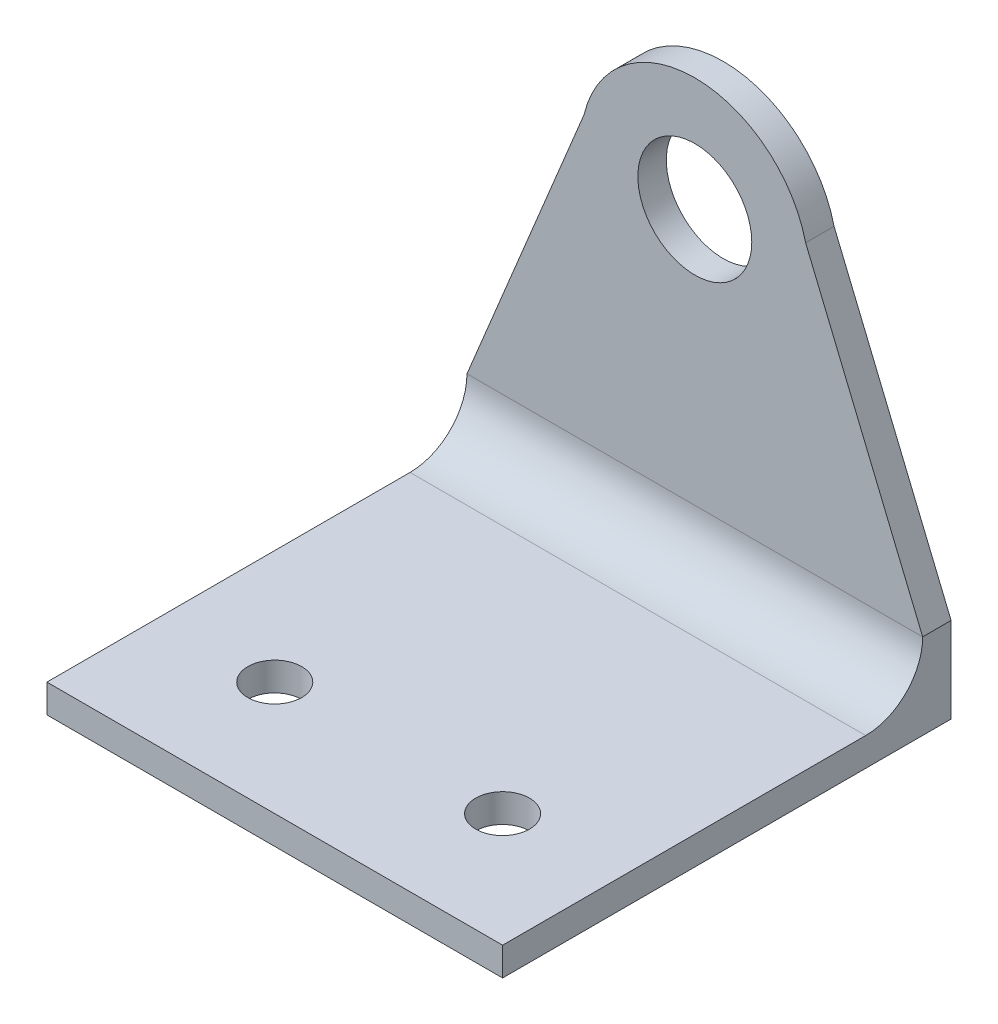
ISO-10303-21;
HEADER;
FILE_DESCRIPTION(('STEP AP214'),'2;1');
FILE_NAME('part.step','',(''),(''),'','','');
FILE_SCHEMA(('AUTOMOTIVE_DESIGN { 1 0 10303 214 1 1 1 1 }'));
ENDSEC;
DATA;
#1=APPLICATION_CONTEXT('core data for automotive mechanical design processes');
#2=APPLICATION_PROTOCOL_DEFINITION('international standard','automotive_design',2000,#1);
#3=PRODUCT_CONTEXT('',#1,'mechanical');
#4=PRODUCT('Part','Part','',(#3));
#5=PRODUCT_RELATED_PRODUCT_CATEGORY('part','',(#4));
#6=PRODUCT_DEFINITION_FORMATION('','',#4);
#7=PRODUCT_DEFINITION_CONTEXT('part definition',#1,'design');
#8=PRODUCT_DEFINITION('design','',#6,#7);
#9=PRODUCT_DEFINITION_SHAPE('','',#8);
#10=(LENGTH_UNIT() NAMED_UNIT(*) SI_UNIT(.MILLI.,.METRE.));
#11=(NAMED_UNIT(*) PLANE_ANGLE_UNIT() SI_UNIT($,.RADIAN.));
#12=(NAMED_UNIT(*) SI_UNIT($,.STERADIAN.) SOLID_ANGLE_UNIT());
#13=UNCERTAINTY_MEASURE_WITH_UNIT(LENGTH_MEASURE(1.E-05),#10,'distance_accuracy_value','');
#14=(GEOMETRIC_REPRESENTATION_CONTEXT(3) GLOBAL_UNCERTAINTY_ASSIGNED_CONTEXT((#13)) GLOBAL_UNIT_ASSIGNED_CONTEXT((#10,
#11,#12)) REPRESENTATION_CONTEXT('',''));
#15=CARTESIAN_POINT('',(0.,0.,0.));
#16=DIRECTION('',(0.,0.,1.));
#17=DIRECTION('',(1.,0.,0.));
#18=AXIS2_PLACEMENT_3D('',#15,#16,#17);
#19=CARTESIAN_POINT('',(25.4,0.,-50.));
#20=DIRECTION('',(0.,0.,1.));
#21=DIRECTION('',(1.,0.,0.));
#22=AXIS2_PLACEMENT_3D('',#19,#20,#21);
#23=PLANE('',#22);
#24=CARTESIAN_POINT('',(0.,38.1,-50.));
#25=DIRECTION('',(0.,0.,1.));
#26=DIRECTION('',(1.,0.,0.));
#27=AXIS2_PLACEMENT_3D('',#24,#25,#26);
#28=CIRCLE('',#27,6.35);
#29=CARTESIAN_POINT('',(6.35,38.1,-50.));
#30=VERTEX_POINT('',#29);
#31=EDGE_CURVE('E208',#30,#30,#28,.T.);
#32=ORIENTED_EDGE('',*,*,#31,.T.);
#33=EDGE_LOOP('',(#32));
#34=FACE_BOUND('',#33,.T.);
#35=CARTESIAN_POINT('',(0.,38.1,-50.));
#36=DIRECTION('',(0.,0.,1.));
#37=DIRECTION('',(1.,0.,0.));
#38=AXIS2_PLACEMENT_3D('',#35,#36,#37);
#39=CIRCLE('',#38,12.7);
#40=CARTESIAN_POINT('',(12.3546091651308,41.0417056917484,-50.));
#41=VERTEX_POINT('',#40);
#42=CARTESIAN_POINT('',(-12.3546091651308,41.0417056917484,-50.));
#43=VERTEX_POINT('',#42);
#44=EDGE_CURVE('E218',#41,#43,#39,.T.);
#45=ORIENTED_EDGE('',*,*,#44,.F.);
#46=DIRECTION('',(-0.382400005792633,0.92399688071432,0.));
#47=VECTOR('',#46,1.);
#48=CARTESIAN_POINT('',(32.4326226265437,-7.47299495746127,-50.));
#49=LINE('',#48,#47);
#50=CARTESIAN_POINT('',(25.4,9.52,-50.));
#51=VERTEX_POINT('',#50);
#52=EDGE_CURVE('E137',#51,#41,#49,.T.);
#53=ORIENTED_EDGE('',*,*,#52,.F.);
#54=DIRECTION('',(0.,1.,0.));
#55=VECTOR('',#54,1.);
#56=CARTESIAN_POINT('',(25.4,0.,-50.));
#57=LINE('',#56,#55);
#58=CARTESIAN_POINT('',(25.4,0.,-50.));
#59=VERTEX_POINT('',#58);
#60=EDGE_CURVE('E136',#59,#51,#57,.T.);
#61=ORIENTED_EDGE('',*,*,#60,.F.);
#62=DIRECTION('',(-1.,0.,0.));
#63=VECTOR('',#62,1.);
#64=CARTESIAN_POINT('',(25.4,0.,-50.));
#65=LINE('',#64,#63);
#66=CARTESIAN_POINT('',(-25.4,0.,-50.));
#67=VERTEX_POINT('',#66);
#68=EDGE_CURVE('E156',#59,#67,#65,.T.);
#69=ORIENTED_EDGE('',*,*,#68,.T.);
#70=DIRECTION('',(0.,1.,0.));
#71=VECTOR('',#70,1.);
#72=CARTESIAN_POINT('',(-25.4,0.,-50.));
#73=LINE('',#72,#71);
#74=CARTESIAN_POINT('',(-25.4,9.52,-50.));
#75=VERTEX_POINT('',#74);
#76=EDGE_CURVE('E171',#67,#75,#73,.T.);
#77=ORIENTED_EDGE('',*,*,#76,.T.);
#78=DIRECTION('',(0.382400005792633,0.92399688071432,0.));
#79=VECTOR('',#78,1.);
#80=CARTESIAN_POINT('',(-32.4326226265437,-7.47299495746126,-50.));
#81=LINE('',#80,#79);
#82=EDGE_CURVE('E72',#75,#43,#81,.T.);
#83=ORIENTED_EDGE('',*,*,#82,.T.);
#84=EDGE_LOOP('',(#45,#53,#61,#69,#77,#83));
#85=FACE_BOUND('',#84,.T.);
#86=ADVANCED_FACE('F57',(#34,#85),#23,.F.);
#87=CARTESIAN_POINT('',(25.4,3.17,-46.83));
#88=DIRECTION('',(0.,0.,-1.));
#89=DIRECTION('',(-1.,0.,0.));
#90=AXIS2_PLACEMENT_3D('',#87,#88,#89);
#91=PLANE('',#90);
#92=CARTESIAN_POINT('',(0.,38.1,-46.83));
#93=DIRECTION('',(0.,0.,1.));
#94=DIRECTION('',(1.,0.,0.));
#95=AXIS2_PLACEMENT_3D('',#92,#93,#94);
#96=CIRCLE('',#95,6.35);
#97=CARTESIAN_POINT('',(6.35,38.1,-46.83));
#98=VERTEX_POINT('',#97);
#99=EDGE_CURVE('E209',#98,#98,#96,.T.);
#100=ORIENTED_EDGE('',*,*,#99,.F.);
#101=EDGE_LOOP('',(#100));
#102=FACE_BOUND('',#101,.T.);
#103=DIRECTION('',(-0.382400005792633,0.92399688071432,0.));
#104=VECTOR('',#103,1.);
#105=CARTESIAN_POINT('',(32.4326226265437,-7.47299495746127,-46.83));
#106=LINE('',#105,#104);
#107=CARTESIAN_POINT('',(25.4,9.52,-46.83));
#108=VERTEX_POINT('',#107);
#109=CARTESIAN_POINT('',(12.3546091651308,41.0417056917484,-46.83));
#110=VERTEX_POINT('',#109);
#111=EDGE_CURVE('E122',#108,#110,#106,.T.);
#112=ORIENTED_EDGE('',*,*,#111,.T.);
#113=CARTESIAN_POINT('',(0.,38.1,-46.83));
#114=DIRECTION('',(0.,0.,1.));
#115=DIRECTION('',(1.,0.,0.));
#116=AXIS2_PLACEMENT_3D('',#113,#114,#115);
#117=CIRCLE('',#116,12.7);
#118=CARTESIAN_POINT('',(-12.3546091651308,41.0417056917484,-46.83));
#119=VERTEX_POINT('',#118);
#120=EDGE_CURVE('E219',#110,#119,#117,.T.);
#121=ORIENTED_EDGE('',*,*,#120,.T.);
#122=DIRECTION('',(0.382400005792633,0.92399688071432,0.));
#123=VECTOR('',#122,1.);
#124=CARTESIAN_POINT('',(-32.4326226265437,-7.47299495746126,-46.83));
#125=LINE('',#124,#123);
#126=CARTESIAN_POINT('',(-25.4,9.52,-46.83));
#127=VERTEX_POINT('',#126);
#128=EDGE_CURVE('E144',#127,#119,#125,.T.);
#129=ORIENTED_EDGE('',*,*,#128,.F.);
#130=DIRECTION('',(-1.,0.,0.));
#131=VECTOR('',#130,1.);
#132=CARTESIAN_POINT('',(25.4,9.52,-46.83));
#133=LINE('',#132,#131);
#134=EDGE_CURVE('E141',#127,#108,#133,.F.);
#135=ORIENTED_EDGE('',*,*,#134,.T.);
#136=EDGE_LOOP('',(#112,#121,#129,#135));
#137=FACE_BOUND('',#136,.T.);
#138=ADVANCED_FACE('F142',(#102,#137),#91,.F.);
#139=CARTESIAN_POINT('',(25.4,0.,0.));
#140=DIRECTION('',(1.,0.,0.));
#141=DIRECTION('',(0.,0.,-1.));
#142=AXIS2_PLACEMENT_3D('',#139,#140,#141);
#143=PLANE('',#142);
#144=ORIENTED_EDGE('',*,*,#60,.T.);
#145=DIRECTION('',(0.,0.,1.));
#146=VECTOR('',#145,1.);
#147=CARTESIAN_POINT('',(25.4,9.52,-50.));
#148=LINE('',#147,#146);
#149=EDGE_CURVE('E125',#51,#108,#148,.T.);
#150=ORIENTED_EDGE('',*,*,#149,.T.);
#151=CARTESIAN_POINT('',(25.4,9.52,-40.48));
#152=DIRECTION('',(1.,0.,0.));
#153=DIRECTION('',(0.,0.,-1.));
#154=AXIS2_PLACEMENT_3D('',#151,#152,#153);
#155=CIRCLE('',#154,6.35);
#156=CARTESIAN_POINT('',(25.4,3.17,-40.48));
#157=VERTEX_POINT('',#156);
#158=EDGE_CURVE('E12',#108,#157,#155,.F.);
#159=ORIENTED_EDGE('',*,*,#158,.T.);
#160=DIRECTION('',(0.,0.,1.));
#161=VECTOR('',#160,1.);
#162=CARTESIAN_POINT('',(25.4,3.17,0.));
#163=LINE('',#162,#161);
#164=CARTESIAN_POINT('',(25.4,3.17,0.));
#165=VERTEX_POINT('',#164);
#166=EDGE_CURVE('E181',#157,#165,#163,.T.);
#167=ORIENTED_EDGE('',*,*,#166,.T.);
#168=DIRECTION('',(0.,-1.,0.));
#169=VECTOR('',#168,1.);
#170=CARTESIAN_POINT('',(25.4,3.17,0.));
#171=LINE('',#170,#169);
#172=CARTESIAN_POINT('',(25.4,0.,0.));
#173=VERTEX_POINT('',#172);
#174=EDGE_CURVE('E170',#165,#173,#171,.T.);
#175=ORIENTED_EDGE('',*,*,#174,.T.);
#176=DIRECTION('',(0.,0.,-1.));
#177=VECTOR('',#176,1.);
#178=CARTESIAN_POINT('',(25.4,0.,0.));
#179=LINE('',#178,#177);
#180=EDGE_CURVE('E174',#173,#59,#179,.T.);
#181=ORIENTED_EDGE('',*,*,#180,.T.);
#182=EDGE_LOOP('',(#144,#150,#159,#167,#175,#181));
#183=FACE_BOUND('',#182,.T.);
#184=ADVANCED_FACE('F134',(#183),#143,.T.);
#185=CARTESIAN_POINT('',(25.4,3.17,0.));
#186=DIRECTION('',(0.,0.,-1.));
#187=DIRECTION('',(-1.,0.,0.));
#188=AXIS2_PLACEMENT_3D('',#185,#186,#187);
#189=PLANE('',#188);
#190=DIRECTION('',(0.,-1.,0.));
#191=VECTOR('',#190,1.);
#192=CARTESIAN_POINT('',(-25.4,3.17,0.));
#193=LINE('',#192,#191);
#194=CARTESIAN_POINT('',(-25.4,3.17,0.));
#195=VERTEX_POINT('',#194);
#196=CARTESIAN_POINT('',(-25.4,0.,0.));
#197=VERTEX_POINT('',#196);
#198=EDGE_CURVE('E167',#195,#197,#193,.T.);
#199=ORIENTED_EDGE('',*,*,#198,.T.);
#200=DIRECTION('',(-1.,0.,0.));
#201=VECTOR('',#200,1.);
#202=CARTESIAN_POINT('',(25.4,0.,0.));
#203=LINE('',#202,#201);
#204=EDGE_CURVE('E153',#173,#197,#203,.T.);
#205=ORIENTED_EDGE('',*,*,#204,.F.);
#206=ORIENTED_EDGE('',*,*,#174,.F.);
#207=DIRECTION('',(-1.,0.,0.));
#208=VECTOR('',#207,1.);
#209=CARTESIAN_POINT('',(25.4,3.17,0.));
#210=LINE('',#209,#208);
#211=EDGE_CURVE('E180',#165,#195,#210,.T.);
#212=ORIENTED_EDGE('',*,*,#211,.T.);
#213=EDGE_LOOP('',(#199,#205,#206,#212));
#214=FACE_BOUND('',#213,.T.);
#215=ADVANCED_FACE('F190',(#214),#189,.F.);
#216=CARTESIAN_POINT('',(25.4,0.,0.));
#217=DIRECTION('',(0.,1.,0.));
#218=DIRECTION('',(0.,0.,1.));
#219=AXIS2_PLACEMENT_3D('',#216,#217,#218);
#220=PLANE('',#219);
#221=CARTESIAN_POINT('',(-12.7,0.,-12.7));
#222=DIRECTION('',(0.,1.,0.));
#223=DIRECTION('',(0.,0.,1.));
#224=AXIS2_PLACEMENT_3D('',#221,#222,#223);
#225=CIRCLE('',#224,3.);
#226=CARTESIAN_POINT('',(-12.7,0.,-9.7));
#227=VERTEX_POINT('',#226);
#228=EDGE_CURVE('E202',#227,#227,#225,.T.);
#229=ORIENTED_EDGE('',*,*,#228,.T.);
#230=EDGE_LOOP('',(#229));
#231=FACE_BOUND('',#230,.T.);
#232=CARTESIAN_POINT('',(12.7,0.,-12.7));
#233=DIRECTION('',(0.,1.,0.));
#234=DIRECTION('',(0.,0.,1.));
#235=AXIS2_PLACEMENT_3D('',#232,#233,#234);
#236=CIRCLE('',#235,3.);
#237=CARTESIAN_POINT('',(12.7,0.,-9.7));
#238=VERTEX_POINT('',#237);
#239=EDGE_CURVE('E191',#238,#238,#236,.T.);
#240=ORIENTED_EDGE('',*,*,#239,.T.);
#241=EDGE_LOOP('',(#240));
#242=FACE_BOUND('',#241,.T.);
#243=DIRECTION('',(0.,0.,-1.));
#244=VECTOR('',#243,1.);
#245=CARTESIAN_POINT('',(-25.4,0.,0.));
#246=LINE('',#245,#244);
#247=EDGE_CURVE('E176',#197,#67,#246,.T.);
#248=ORIENTED_EDGE('',*,*,#247,.T.);
#249=ORIENTED_EDGE('',*,*,#68,.F.);
#250=ORIENTED_EDGE('',*,*,#180,.F.);
#251=ORIENTED_EDGE('',*,*,#204,.T.);
#252=EDGE_LOOP('',(#248,#249,#250,#251));
#253=FACE_BOUND('',#252,.T.);
#254=ADVANCED_FACE('F187',(#231,#242,#253),#220,.F.);
#255=CARTESIAN_POINT('',(25.4,3.17,0.));
#256=DIRECTION('',(0.,-1.,0.));
#257=DIRECTION('',(0.,0.,-1.));
#258=AXIS2_PLACEMENT_3D('',#255,#256,#257);
#259=PLANE('',#258);
#260=CARTESIAN_POINT('',(-12.7,3.17,-12.7));
#261=DIRECTION('',(0.,1.,0.));
#262=DIRECTION('',(0.,0.,1.));
#263=AXIS2_PLACEMENT_3D('',#260,#261,#262);
#264=CIRCLE('',#263,2.99999999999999);
#265=CARTESIAN_POINT('',(-12.7,3.17,-9.70000000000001));
#266=VERTEX_POINT('',#265);
#267=EDGE_CURVE('E205',#266,#266,#264,.T.);
#268=ORIENTED_EDGE('',*,*,#267,.F.);
#269=EDGE_LOOP('',(#268));
#270=FACE_BOUND('',#269,.T.);
#271=CARTESIAN_POINT('',(12.7,3.17,-12.7));
#272=DIRECTION('',(0.,1.,0.));
#273=DIRECTION('',(0.,0.,1.));
#274=AXIS2_PLACEMENT_3D('',#271,#272,#273);
#275=CIRCLE('',#274,2.99999999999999);
#276=CARTESIAN_POINT('',(12.7,3.17,-9.70000000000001));
#277=VERTEX_POINT('',#276);
#278=EDGE_CURVE('E194',#277,#277,#275,.T.);
#279=ORIENTED_EDGE('',*,*,#278,.F.);
#280=EDGE_LOOP('',(#279));
#281=FACE_BOUND('',#280,.T.);
#282=ORIENTED_EDGE('',*,*,#166,.F.);
#283=DIRECTION('',(-1.,0.,0.));
#284=VECTOR('',#283,1.);
#285=CARTESIAN_POINT('',(-25.4,3.17,-40.48));
#286=LINE('',#285,#284);
#287=CARTESIAN_POINT('',(-25.4,3.17,-40.48));
#288=VERTEX_POINT('',#287);
#289=EDGE_CURVE('E147',#157,#288,#286,.T.);
#290=ORIENTED_EDGE('',*,*,#289,.T.);
#291=DIRECTION('',(0.,0.,1.));
#292=VECTOR('',#291,1.);
#293=CARTESIAN_POINT('',(-25.4,3.17,0.));
#294=LINE('',#293,#292);
#295=EDGE_CURVE('E165',#288,#195,#294,.T.);
#296=ORIENTED_EDGE('',*,*,#295,.T.);
#297=ORIENTED_EDGE('',*,*,#211,.F.);
#298=EDGE_LOOP('',(#282,#290,#296,#297));
#299=FACE_BOUND('',#298,.T.);
#300=ADVANCED_FACE('F247',(#270,#281,#299),#259,.F.);
#301=CARTESIAN_POINT('',(-25.4,0.,0.));
#302=DIRECTION('',(1.,0.,0.));
#303=DIRECTION('',(0.,0.,-1.));
#304=AXIS2_PLACEMENT_3D('',#301,#302,#303);
#305=PLANE('',#304);
#306=CARTESIAN_POINT('',(-25.4,9.52,-40.48));
#307=DIRECTION('',(1.,0.,0.));
#308=DIRECTION('',(0.,0.,-1.));
#309=AXIS2_PLACEMENT_3D('',#306,#307,#308);
#310=CIRCLE('',#309,6.35);
#311=EDGE_CURVE('E65',#288,#127,#310,.T.);
#312=ORIENTED_EDGE('',*,*,#311,.T.);
#313=DIRECTION('',(0.,0.,1.));
#314=VECTOR('',#313,1.);
#315=CARTESIAN_POINT('',(-25.4,9.52,-50.));
#316=LINE('',#315,#314);
#317=EDGE_CURVE('E162',#75,#127,#316,.T.);
#318=ORIENTED_EDGE('',*,*,#317,.F.);
#319=ORIENTED_EDGE('',*,*,#76,.F.);
#320=ORIENTED_EDGE('',*,*,#247,.F.);
#321=ORIENTED_EDGE('',*,*,#198,.F.);
#322=ORIENTED_EDGE('',*,*,#295,.F.);
#323=EDGE_LOOP('',(#312,#318,#319,#320,#321,#322));
#324=FACE_BOUND('',#323,.T.);
#325=ADVANCED_FACE('F160',(#324),#305,.F.);
#326=CARTESIAN_POINT('',(25.4,9.52,-40.48));
#327=DIRECTION('',(1.,0.,0.));
#328=DIRECTION('',(0.,0.,-1.));
#329=AXIS2_PLACEMENT_3D('',#326,#327,#328);
#330=CYLINDRICAL_SURFACE('',#329,6.35);
#331=ORIENTED_EDGE('',*,*,#158,.F.);
#332=ORIENTED_EDGE('',*,*,#134,.F.);
#333=ORIENTED_EDGE('',*,*,#311,.F.);
#334=ORIENTED_EDGE('',*,*,#289,.F.);
#335=EDGE_LOOP('',(#331,#332,#333,#334));
#336=FACE_BOUND('',#335,.T.);
#337=ADVANCED_FACE('F59',(#336),#330,.F.);
#338=CARTESIAN_POINT('',(12.7,3.17,-12.7));
#339=DIRECTION('',(0.,1.,0.));
#340=DIRECTION('',(0.,0.,1.));
#341=AXIS2_PLACEMENT_3D('',#338,#339,#340);
#342=CYLINDRICAL_SURFACE('',#341,2.99999999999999);
#343=ORIENTED_EDGE('',*,*,#239,.F.);
#344=EDGE_LOOP('',(#343));
#345=FACE_BOUND('',#344,.T.);
#346=ORIENTED_EDGE('',*,*,#278,.T.);
#347=EDGE_LOOP('',(#346));
#348=FACE_BOUND('',#347,.T.);
#349=ADVANCED_FACE('F258',(#345,#348),#342,.F.);
#350=CARTESIAN_POINT('',(-12.7,3.17,-12.7));
#351=DIRECTION('',(0.,1.,0.));
#352=DIRECTION('',(0.,0.,1.));
#353=AXIS2_PLACEMENT_3D('',#350,#351,#352);
#354=CYLINDRICAL_SURFACE('',#353,2.99999999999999);
#355=ORIENTED_EDGE('',*,*,#228,.F.);
#356=EDGE_LOOP('',(#355));
#357=FACE_BOUND('',#356,.T.);
#358=ORIENTED_EDGE('',*,*,#267,.T.);
#359=EDGE_LOOP('',(#358));
#360=FACE_BOUND('',#359,.T.);
#361=ADVANCED_FACE('F270',(#357,#360),#354,.F.);
#362=CARTESIAN_POINT('',(0.,38.1,-50.));
#363=DIRECTION('',(0.,0.,1.));
#364=DIRECTION('',(1.,0.,0.));
#365=AXIS2_PLACEMENT_3D('',#362,#363,#364);
#366=CYLINDRICAL_SURFACE('',#365,6.35);
#367=CARTESIAN_POINT('',(6.35,38.1,-50.));
#368=CARTESIAN_POINT('',(6.35,38.1,-49.9669791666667));
#369=CARTESIAN_POINT('',(6.35,38.1,-49.9339583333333));
#370=CARTESIAN_POINT('',(6.35,38.1,-49.8679166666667));
#371=CARTESIAN_POINT('',(6.35,38.1,-49.8348958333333));
#372=CARTESIAN_POINT('',(6.35,38.1,-49.7688541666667));
#373=CARTESIAN_POINT('',(6.35,38.1,-49.7358333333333));
#374=CARTESIAN_POINT('',(6.35,38.1,-49.6697916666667));
#375=CARTESIAN_POINT('',(6.35,38.1,-49.6367708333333));
#376=CARTESIAN_POINT('',(6.35,38.1,-49.5707291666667));
#377=CARTESIAN_POINT('',(6.35,38.1,-49.5377083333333));
#378=CARTESIAN_POINT('',(6.35,38.1,-49.4716666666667));
#379=CARTESIAN_POINT('',(6.35,38.1,-49.4386458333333));
#380=CARTESIAN_POINT('',(6.35,38.1,-49.3726041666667));
#381=CARTESIAN_POINT('',(6.35,38.1,-49.3395833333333));
#382=CARTESIAN_POINT('',(6.35,38.1,-49.2735416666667));
#383=CARTESIAN_POINT('',(6.35,38.1,-49.2405208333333));
#384=CARTESIAN_POINT('',(6.35,38.1,-49.1744791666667));
#385=CARTESIAN_POINT('',(6.35,38.1,-49.1414583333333));
#386=CARTESIAN_POINT('',(6.35,38.1,-49.0754166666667));
#387=CARTESIAN_POINT('',(6.35,38.1,-49.0423958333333));
#388=CARTESIAN_POINT('',(6.35,38.1,-48.9763541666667));
#389=CARTESIAN_POINT('',(6.35,38.1,-48.9433333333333));
#390=CARTESIAN_POINT('',(6.35,38.1,-48.8772916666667));
#391=CARTESIAN_POINT('',(6.35,38.1,-48.8442708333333));
#392=CARTESIAN_POINT('',(6.35,38.1,-48.7782291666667));
#393=CARTESIAN_POINT('',(6.35,38.1,-48.7452083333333));
#394=CARTESIAN_POINT('',(6.35,38.1,-48.6791666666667));
#395=CARTESIAN_POINT('',(6.35,38.1,-48.6461458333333));
#396=CARTESIAN_POINT('',(6.35,38.1,-48.5801041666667));
#397=CARTESIAN_POINT('',(6.35,38.1,-48.5470833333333));
#398=CARTESIAN_POINT('',(6.35,38.1,-48.4810416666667));
#399=CARTESIAN_POINT('',(6.35,38.1,-48.4480208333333));
#400=CARTESIAN_POINT('',(6.35,38.1,-48.3819791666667));
#401=CARTESIAN_POINT('',(6.35,38.1,-48.3489583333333));
#402=CARTESIAN_POINT('',(6.35,38.1,-48.2829166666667));
#403=CARTESIAN_POINT('',(6.35,38.1,-48.2498958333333));
#404=CARTESIAN_POINT('',(6.35,38.1,-48.1838541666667));
#405=CARTESIAN_POINT('',(6.35,38.1,-48.1508333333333));
#406=CARTESIAN_POINT('',(6.35,38.1,-48.0847916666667));
#407=CARTESIAN_POINT('',(6.35,38.1,-48.0517708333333));
#408=CARTESIAN_POINT('',(6.35,38.1,-47.9857291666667));
#409=CARTESIAN_POINT('',(6.35,38.1,-47.9527083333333));
#410=CARTESIAN_POINT('',(6.35,38.1,-47.8866666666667));
#411=CARTESIAN_POINT('',(6.35,38.1,-47.8536458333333));
#412=CARTESIAN_POINT('',(6.35,38.1,-47.7876041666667));
#413=CARTESIAN_POINT('',(6.35,38.1,-47.7545833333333));
#414=CARTESIAN_POINT('',(6.35,38.1,-47.6885416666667));
#415=CARTESIAN_POINT('',(6.35,38.1,-47.6555208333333));
#416=CARTESIAN_POINT('',(6.35,38.1,-47.5894791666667));
#417=CARTESIAN_POINT('',(6.35,38.1,-47.5564583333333));
#418=CARTESIAN_POINT('',(6.35,38.1,-47.4904166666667));
#419=CARTESIAN_POINT('',(6.35,38.1,-47.4573958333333));
#420=CARTESIAN_POINT('',(6.35,38.1,-47.3913541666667));
#421=CARTESIAN_POINT('',(6.35,38.1,-47.3583333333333));
#422=CARTESIAN_POINT('',(6.35,38.1,-47.2922916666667));
#423=CARTESIAN_POINT('',(6.35,38.1,-47.2592708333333));
#424=CARTESIAN_POINT('',(6.35,38.1,-47.1932291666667));
#425=CARTESIAN_POINT('',(6.35,38.1,-47.1602083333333));
#426=CARTESIAN_POINT('',(6.35,38.1,-47.0941666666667));
#427=CARTESIAN_POINT('',(6.35,38.1,-47.0611458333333));
#428=CARTESIAN_POINT('',(6.35,38.1,-46.9951041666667));
#429=CARTESIAN_POINT('',(6.35,38.1,-46.9620833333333));
#430=CARTESIAN_POINT('',(6.35,38.1,-46.8960416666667));
#431=CARTESIAN_POINT('',(6.35,38.1,-46.8630208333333));
#432=CARTESIAN_POINT('',(6.35,38.1,-46.83));
#433=B_SPLINE_CURVE_WITH_KNOTS('',3,(#367,#368,#369,#370,#371,#372,#373,#374,#375,#376,#377,
#378,#379,#380,#381,#382,#383,#384,#385,#386,#387,#388,#389,#390,#391,#392,#393,#394,#395,#396,
#397,#398,#399,#400,#401,#402,#403,#404,#405,#406,#407,#408,#409,#410,#411,#412,#413,#414,#415,
#416,#417,#418,#419,#420,#421,#422,#423,#424,#425,#426,#427,#428,#429,#430,#431,#432),
.UNSPECIFIED.,.F.,.F.,(4,2,2,2,2,2,2,2,2,2,2,2,2,2,2,2,2,2,2,2,2,2,2,2,2,2,2,2,2,2,2,2,4),(0.,
0.0990625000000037,0.198125,0.297187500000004,0.396250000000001,0.495312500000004,
0.594375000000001,0.693437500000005,0.792500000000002,0.891562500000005,0.990625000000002,
1.08968750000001,1.18875,1.28781250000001,1.386875,1.48593750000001,1.585,1.68406250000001,
1.783125,1.8821875,1.98125,2.0803125,2.179375,2.2784375,2.3775,2.4765625,2.575625,2.6746875,
2.77375000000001,2.8728125,2.97187500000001,3.0709375,3.17000000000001),.UNSPECIFIED.);
#434=EDGE_CURVE('BSEAM234',#30,#98,#433,.T.);
#435=ORIENTED_EDGE('',*,*,#31,.F.);
#436=ORIENTED_EDGE('',*,*,#99,.T.);
#437=ORIENTED_EDGE('',*,*,#434,.T.);
#438=ORIENTED_EDGE('',*,*,#434,.F.);
#439=EDGE_LOOP('',(#435,#437,#436,#438));
#440=FACE_BOUND('',#439,.T.);
#441=ADVANCED_FACE('F234',(#440),#366,.F.);
#442=CARTESIAN_POINT('',(0.,38.1,-50.));
#443=DIRECTION('',(0.,0.,1.));
#444=DIRECTION('',(1.,0.,0.));
#445=AXIS2_PLACEMENT_3D('',#442,#443,#444);
#446=CYLINDRICAL_SURFACE('',#445,12.7);
#447=ORIENTED_EDGE('',*,*,#120,.F.);
#448=DIRECTION('',(0.,0.,1.));
#449=VECTOR('',#448,1.);
#450=CARTESIAN_POINT('',(12.3546091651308,41.0417056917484,-50.));
#451=LINE('',#450,#449);
#452=EDGE_CURVE('E128',#41,#110,#451,.T.);
#453=ORIENTED_EDGE('',*,*,#452,.F.);
#454=ORIENTED_EDGE('',*,*,#44,.T.);
#455=DIRECTION('',(0.,0.,1.));
#456=VECTOR('',#455,1.);
#457=CARTESIAN_POINT('',(-12.3546091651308,41.0417056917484,-50.));
#458=LINE('',#457,#456);
#459=EDGE_CURVE('E212',#43,#119,#458,.T.);
#460=ORIENTED_EDGE('',*,*,#459,.T.);
#461=EDGE_LOOP('',(#447,#453,#454,#460));
#462=FACE_BOUND('',#461,.T.);
#463=ADVANCED_FACE('F225',(#462),#446,.T.);
#464=CARTESIAN_POINT('',(-32.4326226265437,-7.47299495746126,-50.));
#465=DIRECTION('',(0.92399688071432,-0.382400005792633,0.));
#466=DIRECTION('',(0.382400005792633,0.92399688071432,0.));
#467=AXIS2_PLACEMENT_3D('',#464,#465,#466);
#468=PLANE('',#467);
#469=ORIENTED_EDGE('',*,*,#128,.T.);
#470=ORIENTED_EDGE('',*,*,#459,.F.);
#471=ORIENTED_EDGE('',*,*,#82,.F.);
#472=ORIENTED_EDGE('',*,*,#317,.T.);
#473=EDGE_LOOP('',(#469,#470,#471,#472));
#474=FACE_BOUND('',#473,.T.);
#475=ADVANCED_FACE('F226',(#474),#468,.F.);
#476=CARTESIAN_POINT('',(32.4326226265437,-7.47299495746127,-50.));
#477=DIRECTION('',(0.92399688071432,0.382400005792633,0.));
#478=DIRECTION('',(-0.382400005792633,0.92399688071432,0.));
#479=AXIS2_PLACEMENT_3D('',#476,#477,#478);
#480=PLANE('',#479);
#481=ORIENTED_EDGE('',*,*,#111,.F.);
#482=ORIENTED_EDGE('',*,*,#149,.F.);
#483=ORIENTED_EDGE('',*,*,#52,.T.);
#484=ORIENTED_EDGE('',*,*,#452,.T.);
#485=EDGE_LOOP('',(#481,#482,#483,#484));
#486=FACE_BOUND('',#485,.T.);
#487=ADVANCED_FACE('F123',(#486),#480,.T.);
#488=CLOSED_SHELL('',(#86,#138,#184,#215,#254,#300,#325,#337,#349,#361,#441,#463,#475,#487));
#489=MANIFOLD_SOLID_BREP('B2',#488);
#490=ADVANCED_BREP_SHAPE_REPRESENTATION('',(#18,#489),#14);
#491=SHAPE_DEFINITION_REPRESENTATION(#9,#490);
ENDSEC;
END-ISO-10303-21;
